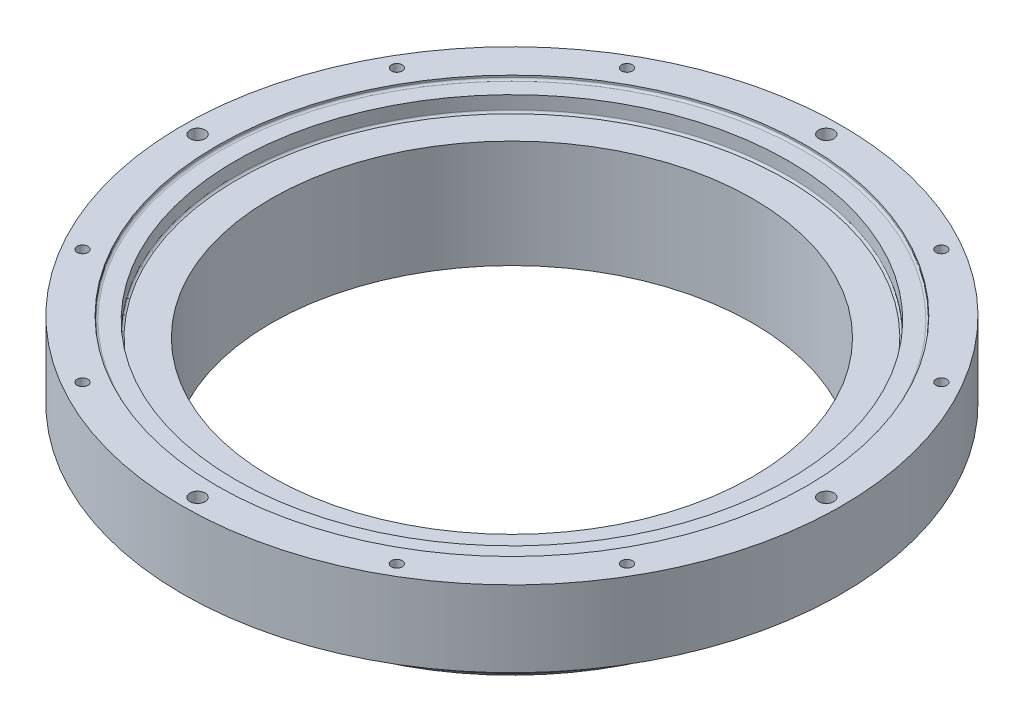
from build123d import *

# Parameters (mm, degrees)
CHAMFER1_SIZE         = 1.27
F_6_CLEARANCE_HOLE1_D = 3.7973
F_6_32_TAPPED_HOLE1_D = 2.7051
F_6_32_TAPPED_HOLE2_D = 2.7051
SKETCH13_R            = 1.905
CUT_EXTRUDE3_DEPTH    = 12.7
CIRPATTERN1_COUNT     = 4
FILLET1_R             = 0.508
FILLET2_R             = 0.508


with BuildPart() as part:
    # Sketch1 → Revolve1 (revolve)
    with BuildSketch(Plane.XY, mode=Mode.PRIVATE) as revolve1_sk:
        Polygon((-60.325, -12.7), (-60.325, 14.300581), (-69.215, 14.300581), (-69.215, 18.0848), (-73.8378, 18.0848), (-73.8378, 19.05), (-82.55, 19.05), (-82.55, 0), (-73.6727, 0), (-73.6727, 2.5654), (-69.1769, 2.5654), (-69.1769, 0), (-66.6369, 0), (-66.6369, -4.69795259), (-63.8683, -4.69795259), (-63.8683, -9.26995259), (-66.6369, -9.26995259), (-66.6369, -12.7), align=None)
    revolve(revolve1_sk.sketch.rotate(Axis((0, 26.197451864, 0), (0, -1, 0)), 270), axis=Axis((0, 26.197451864, 0), (0, -1, 0)))

    # Chamfer1
    chamfer1_edges = [part.edges().sort_by_distance(p)[0] for p in [
        (0, -12.7, -66.6369),
    ]]
    chamfer(chamfer1_edges, length=CHAMFER1_SIZE)

    # 6 Clearance Hole1 (through all)
    with Locations(Plane(origin=(0, 19.05, 0), x_dir=(1, 0, 0), z_dir=(0, 1, 0))):
        with Locations((0, 78.74)):
            f_6_clearance_hole1 = Hole(F_6_CLEARANCE_HOLE1_D / 2)

    # 6-32 Tapped Hole1 (through all)
    with Locations(Plane(origin=(0, 19.05, 0), x_dir=(1, 0, 0), z_dir=(0, 1, 0))):
        with Locations((39.37, 68.190840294)):
            f_6_32_tapped_hole1 = Hole(F_6_32_TAPPED_HOLE1_D / 2)

    # 6-32 Tapped Hole2 (through all)
    with Locations(Plane(origin=(0, 19.05, 0), x_dir=(1, 0, 0), z_dir=(0, 1, 0))):
        with Locations((68.190840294, 39.37)):
            f_6_32_tapped_hole2 = Hole(F_6_32_TAPPED_HOLE2_D / 2)

    # Sketch13 → Cut-Extrude3 (cut)
    with BuildSketch(Plane.XZ):
        with Locations(Location((39.37, -68.190840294, 0), (0, 0, 270))):
            Circle(SKETCH13_R)
        with Locations(Location((68.190840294, -39.37, 0), (0, 0, 270))):
            Circle(SKETCH13_R)
    cut_extrude3 = extrude(amount=-CUT_EXTRUDE3_DEPTH, mode=Mode.SUBTRACT)

    # CirPattern1: 6 Clearance Hole1, 6-32 Tapped Hole1, 6-32 Tapped Hole2, Cut-Extrude3 ×4 about axis
    cirpattern1_axis = Axis((0, 0, 0), (0, 1, 0))
    add([f_6_clearance_hole1.rotate(cirpattern1_axis, i * 360 / CIRPATTERN1_COUNT) for i in range(1, CIRPATTERN1_COUNT)], mode=Mode.SUBTRACT)
    add([f_6_32_tapped_hole1.rotate(cirpattern1_axis, i * 360 / CIRPATTERN1_COUNT) for i in range(1, CIRPATTERN1_COUNT)], mode=Mode.SUBTRACT)
    add([f_6_32_tapped_hole2.rotate(cirpattern1_axis, i * 360 / CIRPATTERN1_COUNT) for i in range(1, CIRPATTERN1_COUNT)], mode=Mode.SUBTRACT)
    add([cut_extrude3.rotate(cirpattern1_axis, i * 360 / CIRPATTERN1_COUNT) for i in range(1, CIRPATTERN1_COUNT)], mode=Mode.SUBTRACT)

    # Fillet1
    fillet1_edges = [part.edges().sort_by_distance(p)[0] for p in [
        (0, -9.26995259, -63.8683),
        (0, -4.69795259, -63.8683),
        (0, 0, -66.6369),
        (0, 2.5654, -69.1769),
        (0, 2.5654, -73.6727),
    ]]
    fillet(fillet1_edges, radius=FILLET1_R)

    # Fillet2
    fillet2_edges = [part.edges().sort_by_distance(p)[0] for p in [
        (0, 18.0848, -73.8378),
        (0, 14.300581, -69.215),
    ]]
    fillet(fillet2_edges, radius=FILLET2_R)


solid = part.part
